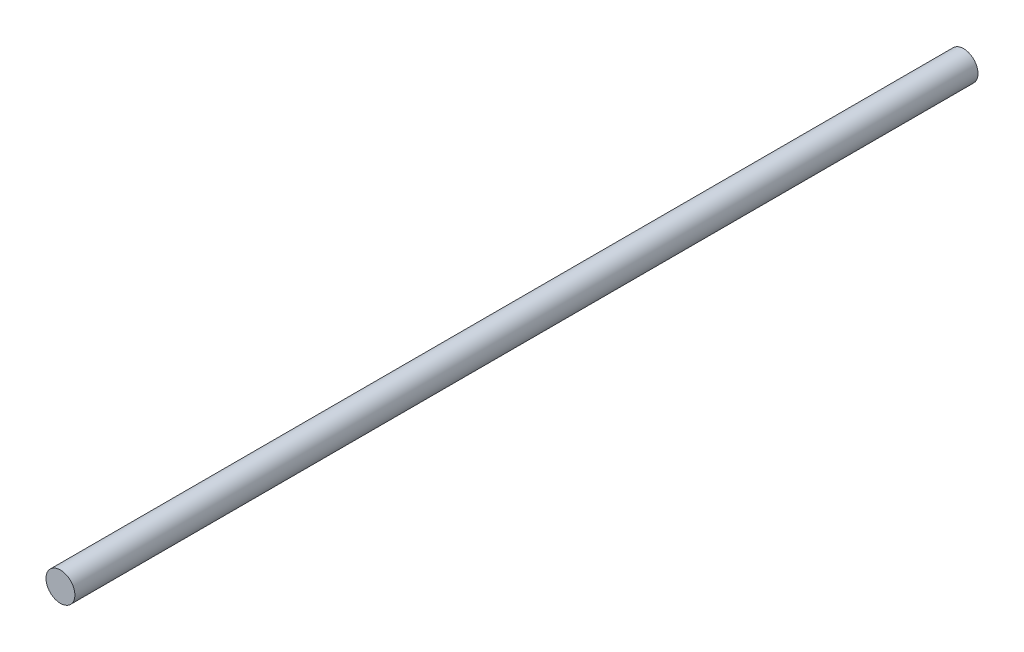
ISO-10303-21;
HEADER;
FILE_DESCRIPTION(('STEP AP214'),'2;1');
FILE_NAME('part.step','',(''),(''),'','','');
FILE_SCHEMA(('AUTOMOTIVE_DESIGN { 1 0 10303 214 1 1 1 1 }'));
ENDSEC;
DATA;
#1=APPLICATION_CONTEXT('core data for automotive mechanical design processes');
#2=APPLICATION_PROTOCOL_DEFINITION('international standard','automotive_design',2000,#1);
#3=PRODUCT_CONTEXT('',#1,'mechanical');
#4=PRODUCT('Part','Part','',(#3));
#5=PRODUCT_RELATED_PRODUCT_CATEGORY('part','',(#4));
#6=PRODUCT_DEFINITION_FORMATION('','',#4);
#7=PRODUCT_DEFINITION_CONTEXT('part definition',#1,'design');
#8=PRODUCT_DEFINITION('design','',#6,#7);
#9=PRODUCT_DEFINITION_SHAPE('','',#8);
#10=(LENGTH_UNIT() NAMED_UNIT(*) SI_UNIT(.MILLI.,.METRE.));
#11=(NAMED_UNIT(*) PLANE_ANGLE_UNIT() SI_UNIT($,.RADIAN.));
#12=(NAMED_UNIT(*) SI_UNIT($,.STERADIAN.) SOLID_ANGLE_UNIT());
#13=UNCERTAINTY_MEASURE_WITH_UNIT(LENGTH_MEASURE(1.E-05),#10,'distance_accuracy_value','');
#14=(GEOMETRIC_REPRESENTATION_CONTEXT(3) GLOBAL_UNCERTAINTY_ASSIGNED_CONTEXT((#13)) GLOBAL_UNIT_ASSIGNED_CONTEXT((#10,
#11,#12)) REPRESENTATION_CONTEXT('',''));
#15=CARTESIAN_POINT('',(0.,0.,0.));
#16=DIRECTION('',(0.,0.,1.));
#17=DIRECTION('',(1.,0.,0.));
#18=AXIS2_PLACEMENT_3D('',#15,#16,#17);
#19=CARTESIAN_POINT('',(0.,0.,25.));
#20=DIRECTION('',(0.,0.,-1.));
#21=DIRECTION('',(-1.,0.,0.));
#22=AXIS2_PLACEMENT_3D('',#19,#20,#21);
#23=CYLINDRICAL_SURFACE('',#22,0.4);
#24=CARTESIAN_POINT('',(0.,0.,25.));
#25=DIRECTION('',(0.,0.,1.));
#26=DIRECTION('',(1.,0.,0.));
#27=AXIS2_PLACEMENT_3D('',#24,#25,#26);
#28=CIRCLE('',#27,0.4);
#29=CARTESIAN_POINT('',(0.4,0.,25.));
#30=VERTEX_POINT('',#29);
#31=EDGE_CURVE('E10',#30,#30,#28,.T.);
#32=ORIENTED_EDGE('',*,*,#31,.F.);
#33=EDGE_LOOP('',(#32));
#34=FACE_BOUND('',#33,.T.);
#35=CARTESIAN_POINT('',(0.,0.,0.));
#36=DIRECTION('',(0.,0.,1.));
#37=DIRECTION('',(1.,0.,0.));
#38=AXIS2_PLACEMENT_3D('',#35,#36,#37);
#39=CIRCLE('',#38,0.4);
#40=CARTESIAN_POINT('',(0.4,0.,0.));
#41=VERTEX_POINT('',#40);
#42=EDGE_CURVE('E32',#41,#41,#39,.T.);
#43=ORIENTED_EDGE('',*,*,#42,.T.);
#44=EDGE_LOOP('',(#43));
#45=FACE_BOUND('',#44,.T.);
#46=ADVANCED_FACE('F29',(#34,#45),#23,.T.);
#47=CARTESIAN_POINT('',(0.,0.,25.));
#48=DIRECTION('',(0.,0.,1.));
#49=DIRECTION('',(1.,0.,0.));
#50=AXIS2_PLACEMENT_3D('',#47,#48,#49);
#51=PLANE('',#50);
#52=ORIENTED_EDGE('',*,*,#31,.T.);
#53=EDGE_LOOP('',(#52));
#54=FACE_BOUND('',#53,.T.);
#55=ADVANCED_FACE('F44',(#54),#51,.T.);
#56=CARTESIAN_POINT('',(0.,0.,0.));
#57=DIRECTION('',(0.,0.,1.));
#58=DIRECTION('',(1.,0.,0.));
#59=AXIS2_PLACEMENT_3D('',#56,#57,#58);
#60=PLANE('',#59);
#61=ORIENTED_EDGE('',*,*,#42,.F.);
#62=EDGE_LOOP('',(#61));
#63=FACE_BOUND('',#62,.T.);
#64=ADVANCED_FACE('F42',(#63),#60,.F.);
#65=CLOSED_SHELL('',(#46,#55,#64));
#66=MANIFOLD_SOLID_BREP('B2',#65);
#67=ADVANCED_BREP_SHAPE_REPRESENTATION('',(#18,#66),#14);
#68=SHAPE_DEFINITION_REPRESENTATION(#9,#67);
ENDSEC;
END-ISO-10303-21;
